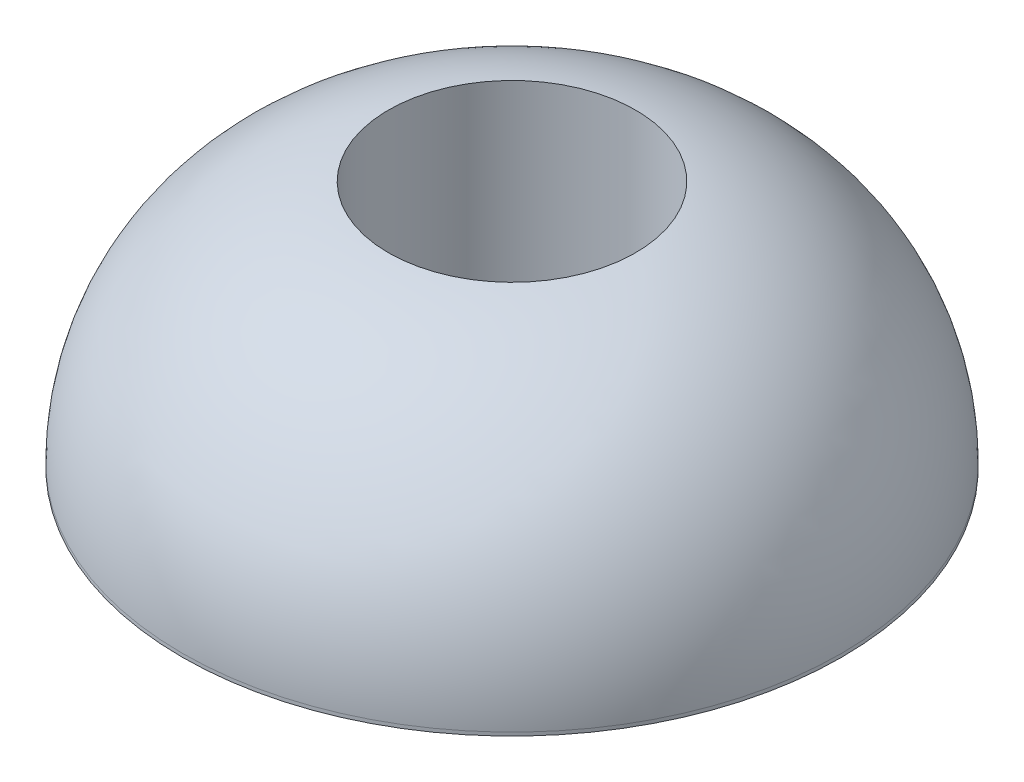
ISO-10303-21;
HEADER;
FILE_DESCRIPTION(('STEP AP214'),'2;1');
FILE_NAME('part.step','',(''),(''),'','','');
FILE_SCHEMA(('AUTOMOTIVE_DESIGN { 1 0 10303 214 1 1 1 1 }'));
ENDSEC;
DATA;
#1=APPLICATION_CONTEXT('core data for automotive mechanical design processes');
#2=APPLICATION_PROTOCOL_DEFINITION('international standard','automotive_design',2000,#1);
#3=PRODUCT_CONTEXT('',#1,'mechanical');
#4=PRODUCT('Part','Part','',(#3));
#5=PRODUCT_RELATED_PRODUCT_CATEGORY('part','',(#4));
#6=PRODUCT_DEFINITION_FORMATION('','',#4);
#7=PRODUCT_DEFINITION_CONTEXT('part definition',#1,'design');
#8=PRODUCT_DEFINITION('design','',#6,#7);
#9=PRODUCT_DEFINITION_SHAPE('','',#8);
#10=(LENGTH_UNIT() NAMED_UNIT(*) SI_UNIT(.MILLI.,.METRE.));
#11=(NAMED_UNIT(*) PLANE_ANGLE_UNIT() SI_UNIT($,.RADIAN.));
#12=(NAMED_UNIT(*) SI_UNIT($,.STERADIAN.) SOLID_ANGLE_UNIT());
#13=UNCERTAINTY_MEASURE_WITH_UNIT(LENGTH_MEASURE(1.E-05),#10,'distance_accuracy_value','');
#14=(GEOMETRIC_REPRESENTATION_CONTEXT(3) GLOBAL_UNCERTAINTY_ASSIGNED_CONTEXT((#13)) GLOBAL_UNIT_ASSIGNED_CONTEXT((#10,
#11,#12)) REPRESENTATION_CONTEXT('',''));
#15=CARTESIAN_POINT('',(0.,0.,0.));
#16=DIRECTION('',(0.,0.,1.));
#17=DIRECTION('',(1.,0.,0.));
#18=AXIS2_PLACEMENT_3D('',#15,#16,#17);
#19=CARTESIAN_POINT('',(0.,6.,0.));
#20=DIRECTION('',(0.,-1.,0.));
#21=DIRECTION('',(0.,0.,-1.));
#22=AXIS2_PLACEMENT_3D('',#19,#20,#21);
#23=CYLINDRICAL_SURFACE('',#22,8.);
#24=CARTESIAN_POINT('',(0.,0.0839202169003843,0.));
#25=DIRECTION('',(0.,1.,0.));
#26=DIRECTION('',(0.,0.,1.));
#27=AXIS2_PLACEMENT_3D('',#24,#25,#26);
#28=CIRCLE('',#27,8.);
#29=CARTESIAN_POINT('',(0.,0.0839202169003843,8.));
#30=VERTEX_POINT('',#29);
#31=EDGE_CURVE('E10',#30,#30,#28,.F.);
#32=ORIENTED_EDGE('',*,*,#31,.T.);
#33=EDGE_LOOP('',(#32));
#34=FACE_BOUND('',#33,.T.);
#35=CARTESIAN_POINT('',(0.,0.,0.));
#36=DIRECTION('',(0.,1.,0.));
#37=DIRECTION('',(0.,0.,1.));
#38=AXIS2_PLACEMENT_3D('',#35,#36,#37);
#39=CIRCLE('',#38,8.);
#40=CARTESIAN_POINT('',(0.,0.,8.));
#41=VERTEX_POINT('',#40);
#42=EDGE_CURVE('E31',#41,#41,#39,.T.);
#43=ORIENTED_EDGE('',*,*,#42,.T.);
#44=EDGE_LOOP('',(#43));
#45=FACE_BOUND('',#44,.T.);
#46=ADVANCED_FACE('F25',(#34,#45),#23,.T.);
#47=CARTESIAN_POINT('',(0.,0.,0.));
#48=DIRECTION('',(0.,1.,0.));
#49=DIRECTION('',(0.,0.,1.));
#50=AXIS2_PLACEMENT_3D('',#47,#48,#49);
#51=PLANE('',#50);
#52=CARTESIAN_POINT('',(0.,0.,0.));
#53=DIRECTION('',(0.,1.,0.));
#54=DIRECTION('',(0.,0.,1.));
#55=AXIS2_PLACEMENT_3D('',#52,#53,#54);
#56=CIRCLE('',#55,3.);
#57=CARTESIAN_POINT('',(0.,0.,3.));
#58=VERTEX_POINT('',#57);
#59=EDGE_CURVE('E35',#58,#58,#56,.T.);
#60=ORIENTED_EDGE('',*,*,#59,.T.);
#61=EDGE_LOOP('',(#60));
#62=FACE_BOUND('',#61,.T.);
#63=ORIENTED_EDGE('',*,*,#42,.F.);
#64=EDGE_LOOP('',(#63));
#65=FACE_BOUND('',#64,.T.);
#66=ADVANCED_FACE('F55',(#62,#65),#51,.F.);
#67=CARTESIAN_POINT('',(0.,0.,0.));
#68=DIRECTION('',(0.,1.,0.));
#69=DIRECTION('',(0.,0.,1.));
#70=AXIS2_PLACEMENT_3D('',#67,#68,#69);
#71=CYLINDRICAL_SURFACE('',#70,3.);
#72=ORIENTED_EDGE('',*,*,#59,.F.);
#73=EDGE_LOOP('',(#72));
#74=FACE_BOUND('',#73,.T.);
#75=CARTESIAN_POINT('',(0.,6.,0.));
#76=DIRECTION('',(0.,1.,0.));
#77=DIRECTION('',(0.,0.,1.));
#78=AXIS2_PLACEMENT_3D('',#75,#76,#77);
#79=CIRCLE('',#78,3.);
#80=CARTESIAN_POINT('',(0.,6.,3.));
#81=VERTEX_POINT('',#80);
#82=EDGE_CURVE('E39',#81,#81,#79,.T.);
#83=ORIENTED_EDGE('',*,*,#82,.T.);
#84=EDGE_LOOP('',(#83));
#85=FACE_BOUND('',#84,.T.);
#86=ADVANCED_FACE('F45',(#74,#85),#71,.F.);
#87=CARTESIAN_POINT('',(0.,0.0839202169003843,0.));
#88=DIRECTION('',(0.,1.,0.));
#89=DIRECTION('',(0.,0.,1.));
#90=AXIS2_PLACEMENT_3D('',#87,#88,#89);
#91=DEGENERATE_TOROIDAL_SURFACE('',#90,2.,6.,.T.);
#92=ORIENTED_EDGE('',*,*,#31,.F.);
#93=EDGE_LOOP('',(#92));
#94=FACE_BOUND('',#93,.T.);
#95=ORIENTED_EDGE('',*,*,#82,.F.);
#96=EDGE_LOOP('',(#95));
#97=FACE_BOUND('',#96,.T.);
#98=ADVANCED_FACE('F47',(#94,#97),#91,.T.);
#99=CLOSED_SHELL('',(#46,#66,#86,#98));
#100=MANIFOLD_SOLID_BREP('B2',#99);
#101=ADVANCED_BREP_SHAPE_REPRESENTATION('',(#18,#100),#14);
#102=SHAPE_DEFINITION_REPRESENTATION(#9,#101);
ENDSEC;
END-ISO-10303-21;
